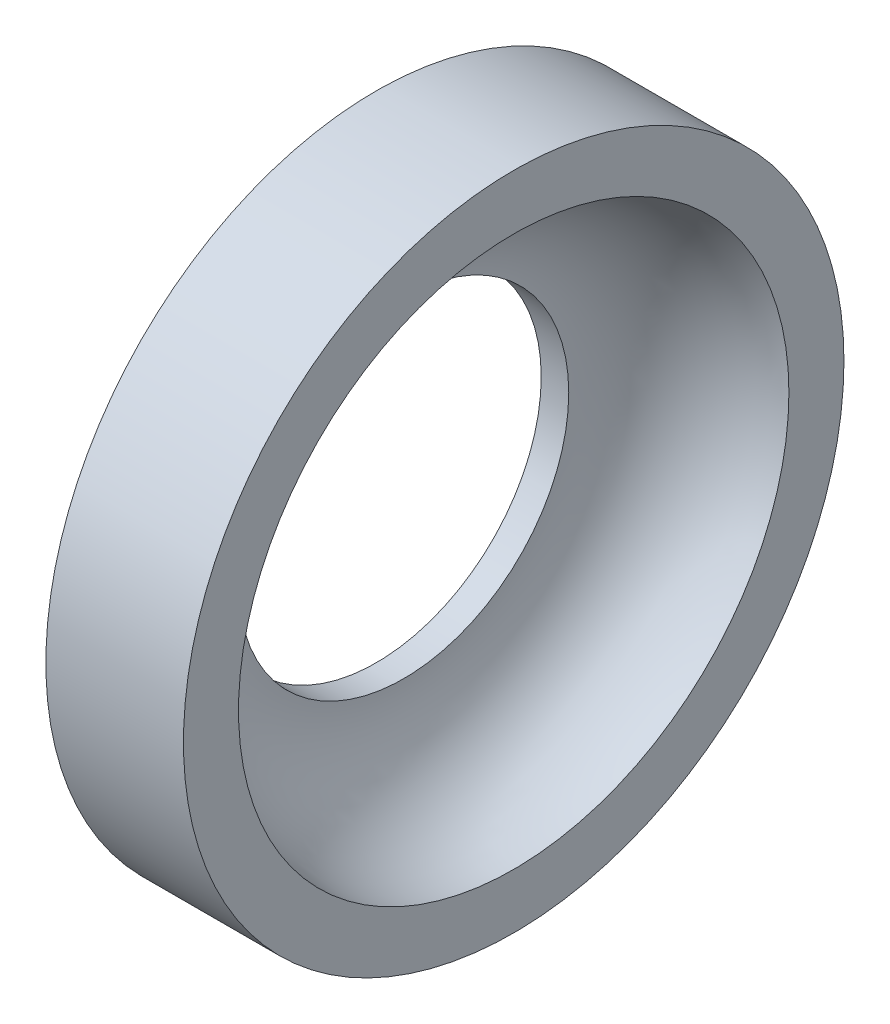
ISO-10303-21;
HEADER;
FILE_DESCRIPTION(('STEP AP214'),'2;1');
FILE_NAME('part.step','',(''),(''),'','','');
FILE_SCHEMA(('AUTOMOTIVE_DESIGN { 1 0 10303 214 1 1 1 1 }'));
ENDSEC;
DATA;
#1=APPLICATION_CONTEXT('core data for automotive mechanical design processes');
#2=APPLICATION_PROTOCOL_DEFINITION('international standard','automotive_design',2000,#1);
#3=PRODUCT_CONTEXT('',#1,'mechanical');
#4=PRODUCT('Part','Part','',(#3));
#5=PRODUCT_RELATED_PRODUCT_CATEGORY('part','',(#4));
#6=PRODUCT_DEFINITION_FORMATION('','',#4);
#7=PRODUCT_DEFINITION_CONTEXT('part definition',#1,'design');
#8=PRODUCT_DEFINITION('design','',#6,#7);
#9=PRODUCT_DEFINITION_SHAPE('','',#8);
#10=(LENGTH_UNIT() NAMED_UNIT(*) SI_UNIT(.MILLI.,.METRE.));
#11=(NAMED_UNIT(*) PLANE_ANGLE_UNIT() SI_UNIT($,.RADIAN.));
#12=(NAMED_UNIT(*) SI_UNIT($,.STERADIAN.) SOLID_ANGLE_UNIT());
#13=UNCERTAINTY_MEASURE_WITH_UNIT(LENGTH_MEASURE(1.E-05),#10,'distance_accuracy_value','');
#14=(GEOMETRIC_REPRESENTATION_CONTEXT(3) GLOBAL_UNCERTAINTY_ASSIGNED_CONTEXT((#13)) GLOBAL_UNIT_ASSIGNED_CONTEXT((#10,
#11,#12)) REPRESENTATION_CONTEXT('',''));
#15=CARTESIAN_POINT('',(0.,0.,0.));
#16=DIRECTION('',(0.,0.,1.));
#17=DIRECTION('',(1.,0.,0.));
#18=AXIS2_PLACEMENT_3D('',#15,#16,#17);
#19=CARTESIAN_POINT('',(0.,0.,0.));
#20=DIRECTION('',(-1.,0.,0.));
#21=DIRECTION('',(0.,0.,1.));
#22=AXIS2_PLACEMENT_3D('',#19,#20,#21);
#23=PLANE('',#22);
#24=CARTESIAN_POINT('',(0.,0.,0.));
#25=DIRECTION('',(1.,0.,0.));
#26=DIRECTION('',(0.,0.,-1.));
#27=AXIS2_PLACEMENT_3D('',#24,#25,#26);
#28=CIRCLE('',#27,6.);
#29=CARTESIAN_POINT('',(0.,0.,-6.));
#30=VERTEX_POINT('',#29);
#31=EDGE_CURVE('E46',#30,#30,#28,.T.);
#32=ORIENTED_EDGE('',*,*,#31,.T.);
#33=EDGE_LOOP('',(#32));
#34=FACE_BOUND('',#33,.T.);
#35=CARTESIAN_POINT('',(0.,0.,0.));
#36=DIRECTION('',(1.,0.,0.));
#37=DIRECTION('',(0.,0.,-1.));
#38=AXIS2_PLACEMENT_3D('',#35,#36,#37);
#39=CIRCLE('',#38,5.);
#40=CARTESIAN_POINT('',(0.,0.,-5.));
#41=VERTEX_POINT('',#40);
#42=EDGE_CURVE('E10',#41,#41,#39,.T.);
#43=ORIENTED_EDGE('',*,*,#42,.F.);
#44=EDGE_LOOP('',(#43));
#45=FACE_BOUND('',#44,.T.);
#46=ADVANCED_FACE('F30',(#34,#45),#23,.F.);
#47=CARTESIAN_POINT('',(-6.,0.,0.));
#48=DIRECTION('',(1.,0.,0.));
#49=DIRECTION('',(0.,0.,-1.));
#50=AXIS2_PLACEMENT_3D('',#47,#48,#49);
#51=CYLINDRICAL_SURFACE('',#50,3.);
#52=CARTESIAN_POINT('',(-2.5,0.,0.));
#53=DIRECTION('',(1.,0.,0.));
#54=DIRECTION('',(0.,0.,-1.));
#55=AXIS2_PLACEMENT_3D('',#52,#53,#54);
#56=CIRCLE('',#55,3.);
#57=CARTESIAN_POINT('',(-2.5,0.,-3.));
#58=VERTEX_POINT('',#57);
#59=EDGE_CURVE('E37',#58,#58,#56,.T.);
#60=ORIENTED_EDGE('',*,*,#59,.F.);
#61=EDGE_LOOP('',(#60));
#62=FACE_BOUND('',#61,.T.);
#63=CARTESIAN_POINT('',(-2.,0.,0.));
#64=DIRECTION('',(1.,0.,0.));
#65=DIRECTION('',(0.,0.,-1.));
#66=AXIS2_PLACEMENT_3D('',#63,#64,#65);
#67=CIRCLE('',#66,3.);
#68=CARTESIAN_POINT('',(-2.,0.,-3.));
#69=VERTEX_POINT('',#68);
#70=EDGE_CURVE('E33',#69,#69,#67,.T.);
#71=ORIENTED_EDGE('',*,*,#70,.T.);
#72=EDGE_LOOP('',(#71));
#73=FACE_BOUND('',#72,.T.);
#74=ADVANCED_FACE('F53',(#62,#73),#51,.F.);
#75=CARTESIAN_POINT('',(0.,0.,0.));
#76=DIRECTION('',(1.,0.,0.));
#77=DIRECTION('',(0.,0.,-1.));
#78=AXIS2_PLACEMENT_3D('',#75,#76,#77);
#79=CYLINDRICAL_SURFACE('',#78,6.);
#80=ORIENTED_EDGE('',*,*,#31,.F.);
#81=EDGE_LOOP('',(#80));
#82=FACE_BOUND('',#81,.T.);
#83=CARTESIAN_POINT('',(-2.5,0.,0.));
#84=DIRECTION('',(1.,0.,0.));
#85=DIRECTION('',(0.,0.,-1.));
#86=AXIS2_PLACEMENT_3D('',#83,#84,#85);
#87=CIRCLE('',#86,6.);
#88=CARTESIAN_POINT('',(-2.5,0.,-6.));
#89=VERTEX_POINT('',#88);
#90=EDGE_CURVE('E41',#89,#89,#87,.T.);
#91=ORIENTED_EDGE('',*,*,#90,.T.);
#92=EDGE_LOOP('',(#91));
#93=FACE_BOUND('',#92,.T.);
#94=ADVANCED_FACE('F62',(#82,#93),#79,.T.);
#95=CARTESIAN_POINT('',(-2.5,-6.,0.));
#96=DIRECTION('',(1.,0.,0.));
#97=DIRECTION('',(0.,0.,-1.));
#98=AXIS2_PLACEMENT_3D('',#95,#96,#97);
#99=PLANE('',#98);
#100=ORIENTED_EDGE('',*,*,#59,.T.);
#101=EDGE_LOOP('',(#100));
#102=FACE_BOUND('',#101,.T.);
#103=ORIENTED_EDGE('',*,*,#90,.F.);
#104=EDGE_LOOP('',(#103));
#105=FACE_BOUND('',#104,.T.);
#106=ADVANCED_FACE('F57',(#102,#105),#99,.F.);
#107=CARTESIAN_POINT('',(0.,0.,0.));
#108=DIRECTION('',(1.,0.,0.));
#109=DIRECTION('',(0.,0.,-1.));
#110=AXIS2_PLACEMENT_3D('',#107,#108,#109);
#111=TOROIDAL_SURFACE('',#110,3.,2.);
#112=ORIENTED_EDGE('',*,*,#70,.F.);
#113=EDGE_LOOP('',(#112));
#114=FACE_BOUND('',#113,.T.);
#115=ORIENTED_EDGE('',*,*,#42,.T.);
#116=EDGE_LOOP('',(#115));
#117=FACE_BOUND('',#116,.T.);
#118=ADVANCED_FACE('F55',(#114,#117),#111,.F.);
#119=CLOSED_SHELL('',(#46,#74,#94,#106,#118));
#120=MANIFOLD_SOLID_BREP('B2',#119);
#121=ADVANCED_BREP_SHAPE_REPRESENTATION('',(#18,#120),#14);
#122=SHAPE_DEFINITION_REPRESENTATION(#9,#121);
ENDSEC;
END-ISO-10303-21;
